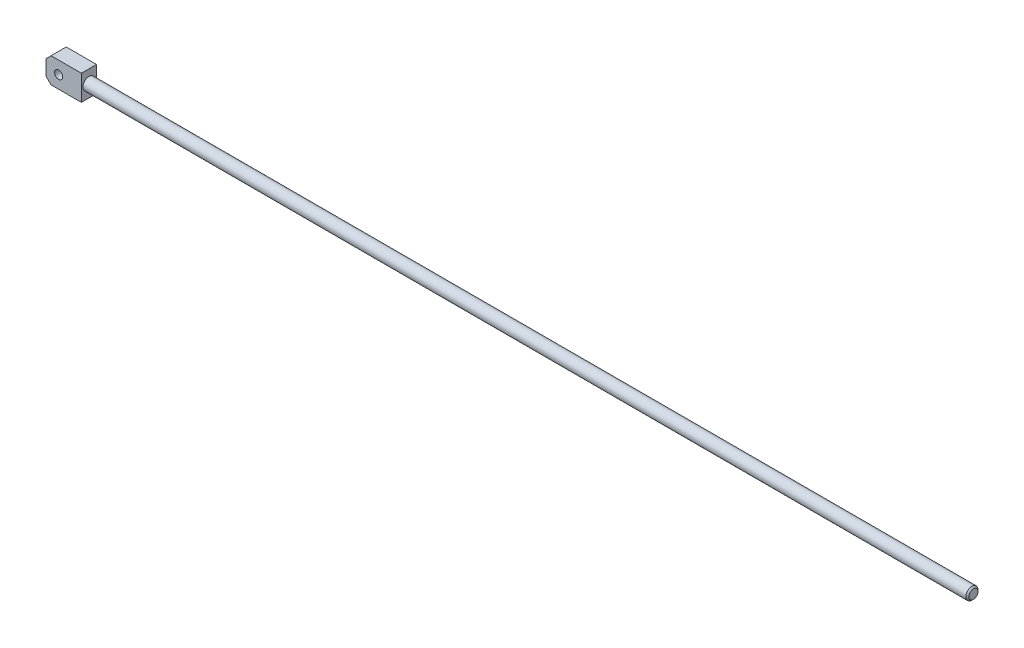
ISO-10303-21;
HEADER;
FILE_DESCRIPTION(('STEP AP214'),'2;1');
FILE_NAME('part.step','',(''),(''),'','','');
FILE_SCHEMA(('AUTOMOTIVE_DESIGN { 1 0 10303 214 1 1 1 1 }'));
ENDSEC;
DATA;
#1=APPLICATION_CONTEXT('core data for automotive mechanical design processes');
#2=APPLICATION_PROTOCOL_DEFINITION('international standard','automotive_design',2000,#1);
#3=PRODUCT_CONTEXT('',#1,'mechanical');
#4=PRODUCT('Part','Part','',(#3));
#5=PRODUCT_RELATED_PRODUCT_CATEGORY('part','',(#4));
#6=PRODUCT_DEFINITION_FORMATION('','',#4);
#7=PRODUCT_DEFINITION_CONTEXT('part definition',#1,'design');
#8=PRODUCT_DEFINITION('design','',#6,#7);
#9=PRODUCT_DEFINITION_SHAPE('','',#8);
#10=(LENGTH_UNIT() NAMED_UNIT(*) SI_UNIT(.MILLI.,.METRE.));
#11=(NAMED_UNIT(*) PLANE_ANGLE_UNIT() SI_UNIT($,.RADIAN.));
#12=(NAMED_UNIT(*) SI_UNIT($,.STERADIAN.) SOLID_ANGLE_UNIT());
#13=UNCERTAINTY_MEASURE_WITH_UNIT(LENGTH_MEASURE(1.E-05),#10,'distance_accuracy_value','');
#14=(GEOMETRIC_REPRESENTATION_CONTEXT(3) GLOBAL_UNCERTAINTY_ASSIGNED_CONTEXT((#13)) GLOBAL_UNIT_ASSIGNED_CONTEXT((#10,
#11,#12)) REPRESENTATION_CONTEXT('',''));
#15=CARTESIAN_POINT('',(0.,0.,0.));
#16=DIRECTION('',(0.,0.,1.));
#17=DIRECTION('',(1.,0.,0.));
#18=AXIS2_PLACEMENT_3D('',#15,#16,#17);
#19=CARTESIAN_POINT('',(-29.9734743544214,-35.8753324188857,0.));
#20=DIRECTION('',(-1.,0.,0.));
#21=DIRECTION('',(0.,0.,1.));
#22=AXIS2_PLACEMENT_3D('',#19,#20,#21);
#23=PLANE('',#22);
#24=DIRECTION('',(0.,0.,1.));
#25=VECTOR('',#24,1.);
#26=CARTESIAN_POINT('',(-29.9734743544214,4.12466758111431,0.));
#27=LINE('',#26,#25);
#28=CARTESIAN_POINT('',(-29.9734743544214,4.12466758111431,0.));
#29=VERTEX_POINT('',#28);
#30=CARTESIAN_POINT('',(-29.9734743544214,4.12466758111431,30.));
#31=VERTEX_POINT('',#30);
#32=EDGE_CURVE('E77',#29,#31,#27,.T.);
#33=ORIENTED_EDGE('',*,*,#32,.F.);
#34=DIRECTION('',(0.,1.,0.));
#35=VECTOR('',#34,1.);
#36=CARTESIAN_POINT('',(-29.9734743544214,-10.8753324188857,0.));
#37=LINE('',#36,#35);
#38=CARTESIAN_POINT('',(-29.9734743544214,-25.8753324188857,0.));
#39=VERTEX_POINT('',#38);
#40=EDGE_CURVE('E107',#29,#39,#37,.F.);
#41=ORIENTED_EDGE('',*,*,#40,.T.);
#42=DIRECTION('',(0.,0.,1.));
#43=VECTOR('',#42,1.);
#44=CARTESIAN_POINT('',(-29.9734743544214,-25.8753324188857,0.));
#45=LINE('',#44,#43);
#46=CARTESIAN_POINT('',(-29.9734743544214,-25.8753324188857,30.));
#47=VERTEX_POINT('',#46);
#48=EDGE_CURVE('E84',#47,#39,#45,.F.);
#49=ORIENTED_EDGE('',*,*,#48,.F.);
#50=DIRECTION('',(0.,1.,0.));
#51=VECTOR('',#50,1.);
#52=CARTESIAN_POINT('',(-29.9734743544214,-10.8753324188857,30.));
#53=LINE('',#52,#51);
#54=EDGE_CURVE('E87',#31,#47,#53,.F.);
#55=ORIENTED_EDGE('',*,*,#54,.F.);
#56=EDGE_LOOP('',(#33,#41,#49,#55));
#57=FACE_BOUND('',#56,.T.);
#58=ADVANCED_FACE('F16',(#57),#23,.T.);
#59=CARTESIAN_POINT('',(-24.9734743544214,-30.8753324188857,0.));
#60=DIRECTION('',(-0.707106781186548,-0.707106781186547,0.));
#61=DIRECTION('',(0.707106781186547,-0.707106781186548,0.));
#62=AXIS2_PLACEMENT_3D('',#59,#60,#61);
#63=PLANE('',#62);
#64=DIRECTION('',(0.707106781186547,-0.707106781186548,0.));
#65=VECTOR('',#64,1.);
#66=CARTESIAN_POINT('',(-29.9734743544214,-25.8753324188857,0.));
#67=LINE('',#66,#65);
#68=CARTESIAN_POINT('',(-19.9734743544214,-35.8753324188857,0.));
#69=VERTEX_POINT('',#68);
#70=EDGE_CURVE('E103',#39,#69,#67,.T.);
#71=ORIENTED_EDGE('',*,*,#70,.T.);
#72=DIRECTION('',(0.,0.,-1.));
#73=VECTOR('',#72,1.);
#74=CARTESIAN_POINT('',(-19.9734743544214,-35.8753324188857,0.));
#75=LINE('',#74,#73);
#76=CARTESIAN_POINT('',(-19.9734743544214,-35.8753324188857,30.));
#77=VERTEX_POINT('',#76);
#78=EDGE_CURVE('E101',#77,#69,#75,.T.);
#79=ORIENTED_EDGE('',*,*,#78,.F.);
#80=DIRECTION('',(0.707106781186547,-0.707106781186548,0.));
#81=VECTOR('',#80,1.);
#82=CARTESIAN_POINT('',(-29.9734743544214,-25.8753324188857,30.));
#83=LINE('',#82,#81);
#84=EDGE_CURVE('E83',#47,#77,#83,.T.);
#85=ORIENTED_EDGE('',*,*,#84,.F.);
#86=ORIENTED_EDGE('',*,*,#48,.T.);
#87=EDGE_LOOP('',(#71,#79,#85,#86));
#88=FACE_BOUND('',#87,.T.);
#89=ADVANCED_FACE('F141',(#88),#63,.T.);
#90=CARTESIAN_POINT('',(-4.97347435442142,-10.8753324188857,30.));
#91=DIRECTION('',(0.,0.,-1.));
#92=DIRECTION('',(-1.,0.,0.));
#93=AXIS2_PLACEMENT_3D('',#90,#91,#92);
#94=CYLINDRICAL_SURFACE('',#93,8.);
#95=CARTESIAN_POINT('',(-4.97347435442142,-10.8753324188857,0.));
#96=DIRECTION('',(0.,0.,-1.));
#97=DIRECTION('',(-1.,0.,0.));
#98=AXIS2_PLACEMENT_3D('',#95,#96,#97);
#99=CIRCLE('',#98,8.);
#100=CARTESIAN_POINT('',(-12.9734743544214,-10.8753324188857,0.));
#101=VERTEX_POINT('',#100);
#102=EDGE_CURVE('E106',#101,#101,#99,.T.);
#103=ORIENTED_EDGE('',*,*,#102,.T.);
#104=EDGE_LOOP('',(#103));
#105=FACE_BOUND('',#104,.T.);
#106=CARTESIAN_POINT('',(-4.97347435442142,-10.8753324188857,30.));
#107=DIRECTION('',(0.,0.,-1.));
#108=DIRECTION('',(-1.,0.,0.));
#109=AXIS2_PLACEMENT_3D('',#106,#107,#108);
#110=CIRCLE('',#109,8.);
#111=CARTESIAN_POINT('',(-12.9734743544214,-10.8753324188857,30.));
#112=VERTEX_POINT('',#111);
#113=EDGE_CURVE('E20',#112,#112,#110,.T.);
#114=ORIENTED_EDGE('',*,*,#113,.F.);
#115=EDGE_LOOP('',(#114));
#116=FACE_BOUND('',#115,.T.);
#117=ADVANCED_FACE('F18',(#105,#116),#94,.F.);
#118=CARTESIAN_POINT('',(-24.9734743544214,9.12466758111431,0.));
#119=DIRECTION('',(-0.707106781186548,0.707106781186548,0.));
#120=DIRECTION('',(-0.707106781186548,-0.707106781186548,0.));
#121=AXIS2_PLACEMENT_3D('',#118,#119,#120);
#122=PLANE('',#121);
#123=DIRECTION('',(-0.707106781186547,-0.707106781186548,0.));
#124=VECTOR('',#123,1.);
#125=CARTESIAN_POINT('',(-19.9734743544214,14.1246675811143,0.));
#126=LINE('',#125,#124);
#127=CARTESIAN_POINT('',(-19.9734743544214,14.1246675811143,0.));
#128=VERTEX_POINT('',#127);
#129=EDGE_CURVE('E80',#128,#29,#126,.T.);
#130=ORIENTED_EDGE('',*,*,#129,.T.);
#131=ORIENTED_EDGE('',*,*,#32,.T.);
#132=DIRECTION('',(-0.707106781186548,-0.707106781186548,0.));
#133=VECTOR('',#132,1.);
#134=CARTESIAN_POINT('',(-19.9734743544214,14.1246675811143,30.));
#135=LINE('',#134,#133);
#136=CARTESIAN_POINT('',(-19.9734743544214,14.1246675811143,30.));
#137=VERTEX_POINT('',#136);
#138=EDGE_CURVE('E56',#137,#31,#135,.T.);
#139=ORIENTED_EDGE('',*,*,#138,.F.);
#140=DIRECTION('',(0.,0.,1.));
#141=VECTOR('',#140,1.);
#142=CARTESIAN_POINT('',(-19.9734743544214,14.1246675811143,0.));
#143=LINE('',#142,#141);
#144=EDGE_CURVE('E60',#128,#137,#143,.T.);
#145=ORIENTED_EDGE('',*,*,#144,.F.);
#146=EDGE_LOOP('',(#130,#131,#139,#145));
#147=FACE_BOUND('',#146,.T.);
#148=ADVANCED_FACE('F79',(#147),#122,.T.);
#149=CARTESIAN_POINT('',(1790.02652564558,-10.8753324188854,15.));
#150=DIRECTION('',(-1.,0.,0.));
#151=DIRECTION('',(0.,0.,1.));
#152=AXIS2_PLACEMENT_3D('',#149,#150,#151);
#153=PLANE('',#152);
#154=CARTESIAN_POINT('',(1790.02652564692,-10.8753324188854,15.));
#155=DIRECTION('',(-1.,0.,0.));
#156=DIRECTION('',(0.,0.,1.));
#157=AXIS2_PLACEMENT_3D('',#154,#155,#156);
#158=CIRCLE('',#157,9.0000000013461);
#159=CARTESIAN_POINT('',(1790.02652564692,-10.8753324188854,24.0000000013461));
#160=VERTEX_POINT('',#159);
#161=EDGE_CURVE('E112',#160,#160,#158,.T.);
#162=ORIENTED_EDGE('',*,*,#161,.F.);
#163=EDGE_LOOP('',(#162));
#164=FACE_BOUND('',#163,.T.);
#165=ADVANCED_FACE('F176',(#164),#153,.F.);
#166=CARTESIAN_POINT('',(5.02652564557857,-10.8753324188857,30.));
#167=DIRECTION('',(0.,0.,1.));
#168=DIRECTION('',(1.,0.,0.));
#169=AXIS2_PLACEMENT_3D('',#166,#167,#168);
#170=PLANE('',#169);
#171=ORIENTED_EDGE('',*,*,#113,.T.);
#172=EDGE_LOOP('',(#171));
#173=FACE_BOUND('',#172,.T.);
#174=ORIENTED_EDGE('',*,*,#138,.T.);
#175=ORIENTED_EDGE('',*,*,#54,.T.);
#176=ORIENTED_EDGE('',*,*,#84,.T.);
#177=DIRECTION('',(1.,0.,0.));
#178=VECTOR('',#177,1.);
#179=CARTESIAN_POINT('',(40.0265256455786,-35.8753324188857,30.));
#180=LINE('',#179,#178);
#181=CARTESIAN_POINT('',(40.0265256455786,-35.8753324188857,30.));
#182=VERTEX_POINT('',#181);
#183=EDGE_CURVE('E97',#182,#77,#180,.F.);
#184=ORIENTED_EDGE('',*,*,#183,.F.);
#185=DIRECTION('',(0.,1.,0.));
#186=VECTOR('',#185,1.);
#187=CARTESIAN_POINT('',(40.0265256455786,14.1246675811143,30.));
#188=LINE('',#187,#186);
#189=CARTESIAN_POINT('',(40.0265256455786,14.1246675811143,30.));
#190=VERTEX_POINT('',#189);
#191=EDGE_CURVE('E48',#190,#182,#188,.F.);
#192=ORIENTED_EDGE('',*,*,#191,.F.);
#193=DIRECTION('',(1.,0.,0.));
#194=VECTOR('',#193,1.);
#195=CARTESIAN_POINT('',(-29.9734743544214,14.1246675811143,30.));
#196=LINE('',#195,#194);
#197=EDGE_CURVE('E93',#137,#190,#196,.T.);
#198=ORIENTED_EDGE('',*,*,#197,.F.);
#199=EDGE_LOOP('',(#174,#175,#176,#184,#192,#198));
#200=FACE_BOUND('',#199,.T.);
#201=ADVANCED_FACE('F92',(#173,#200),#170,.T.);
#202=CARTESIAN_POINT('',(40.0265256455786,-35.8753324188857,0.));
#203=DIRECTION('',(0.,-1.,0.));
#204=DIRECTION('',(0.,0.,-1.));
#205=AXIS2_PLACEMENT_3D('',#202,#203,#204);
#206=PLANE('',#205);
#207=DIRECTION('',(0.,0.,-1.));
#208=VECTOR('',#207,1.);
#209=CARTESIAN_POINT('',(40.0265256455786,-35.8753324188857,0.));
#210=LINE('',#209,#208);
#211=CARTESIAN_POINT('',(40.0265256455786,-35.8753324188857,0.));
#212=VERTEX_POINT('',#211);
#213=EDGE_CURVE('E121',#182,#212,#210,.T.);
#214=ORIENTED_EDGE('',*,*,#213,.F.);
#215=ORIENTED_EDGE('',*,*,#183,.T.);
#216=ORIENTED_EDGE('',*,*,#78,.T.);
#217=DIRECTION('',(1.,0.,0.));
#218=VECTOR('',#217,1.);
#219=CARTESIAN_POINT('',(5.02652564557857,-35.8753324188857,0.));
#220=LINE('',#219,#218);
#221=EDGE_CURVE('E100',#69,#212,#220,.T.);
#222=ORIENTED_EDGE('',*,*,#221,.T.);
#223=EDGE_LOOP('',(#214,#215,#216,#222));
#224=FACE_BOUND('',#223,.T.);
#225=ADVANCED_FACE('F136',(#224),#206,.T.);
#226=CARTESIAN_POINT('',(5.02652564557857,-10.8753324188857,0.));
#227=DIRECTION('',(0.,0.,1.));
#228=DIRECTION('',(1.,0.,0.));
#229=AXIS2_PLACEMENT_3D('',#226,#227,#228);
#230=PLANE('',#229);
#231=ORIENTED_EDGE('',*,*,#102,.F.);
#232=EDGE_LOOP('',(#231));
#233=FACE_BOUND('',#232,.T.);
#234=ORIENTED_EDGE('',*,*,#40,.F.);
#235=ORIENTED_EDGE('',*,*,#129,.F.);
#236=DIRECTION('',(1.,0.,0.));
#237=VECTOR('',#236,1.);
#238=CARTESIAN_POINT('',(-29.9734743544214,14.1246675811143,0.));
#239=LINE('',#238,#237);
#240=CARTESIAN_POINT('',(40.0265256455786,14.1246675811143,0.));
#241=VERTEX_POINT('',#240);
#242=EDGE_CURVE('E35',#241,#128,#239,.F.);
#243=ORIENTED_EDGE('',*,*,#242,.F.);
#244=DIRECTION('',(0.,1.,0.));
#245=VECTOR('',#244,1.);
#246=CARTESIAN_POINT('',(40.0265256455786,14.1246675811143,0.));
#247=LINE('',#246,#245);
#248=EDGE_CURVE('E118',#212,#241,#247,.T.);
#249=ORIENTED_EDGE('',*,*,#248,.F.);
#250=ORIENTED_EDGE('',*,*,#221,.F.);
#251=ORIENTED_EDGE('',*,*,#70,.F.);
#252=EDGE_LOOP('',(#234,#235,#243,#249,#250,#251));
#253=FACE_BOUND('',#252,.T.);
#254=ADVANCED_FACE('F133',(#233,#253),#230,.F.);
#255=CARTESIAN_POINT('',(-29.9734743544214,14.1246675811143,0.));
#256=DIRECTION('',(0.,1.,0.));
#257=DIRECTION('',(0.,0.,1.));
#258=AXIS2_PLACEMENT_3D('',#255,#256,#257);
#259=PLANE('',#258);
#260=DIRECTION('',(0.,0.,-1.));
#261=VECTOR('',#260,1.);
#262=CARTESIAN_POINT('',(40.0265256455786,14.1246675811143,0.));
#263=LINE('',#262,#261);
#264=EDGE_CURVE('E115',#241,#190,#263,.F.);
#265=ORIENTED_EDGE('',*,*,#264,.F.);
#266=ORIENTED_EDGE('',*,*,#242,.T.);
#267=ORIENTED_EDGE('',*,*,#144,.T.);
#268=ORIENTED_EDGE('',*,*,#197,.T.);
#269=EDGE_LOOP('',(#265,#266,#267,#268));
#270=FACE_BOUND('',#269,.T.);
#271=ADVANCED_FACE('F135',(#270),#259,.T.);
#272=CARTESIAN_POINT('',(1787.02652564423,-10.8753324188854,15.));
#273=DIRECTION('',(-1.,0.,0.));
#274=DIRECTION('',(0.,0.,1.));
#275=AXIS2_PLACEMENT_3D('',#272,#273,#274);
#276=CONICAL_SURFACE('',#275,11.9999999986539,0.785398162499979);
#277=ORIENTED_EDGE('',*,*,#161,.T.);
#278=EDGE_LOOP('',(#277));
#279=FACE_BOUND('',#278,.T.);
#280=CARTESIAN_POINT('',(1787.02652564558,-10.8753324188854,15.));
#281=DIRECTION('',(1.,0.,0.));
#282=DIRECTION('',(0.,1.,0.));
#283=AXIS2_PLACEMENT_3D('',#280,#281,#282);
#284=CIRCLE('',#283,12.);
#285=CARTESIAN_POINT('',(1787.02652564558,1.12466758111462,15.));
#286=VERTEX_POINT('',#285);
#287=EDGE_CURVE('E26',#286,#286,#284,.F.);
#288=ORIENTED_EDGE('',*,*,#287,.F.);
#289=EDGE_LOOP('',(#288));
#290=FACE_BOUND('',#289,.T.);
#291=ADVANCED_FACE('F149',(#279,#290),#276,.T.);
#292=CARTESIAN_POINT('',(40.0265256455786,14.1246675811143,0.));
#293=DIRECTION('',(1.,0.,0.));
#294=DIRECTION('',(0.,0.,-1.));
#295=AXIS2_PLACEMENT_3D('',#292,#293,#294);
#296=PLANE('',#295);
#297=CARTESIAN_POINT('',(40.0265256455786,-10.8753324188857,15.));
#298=DIRECTION('',(1.,0.,0.));
#299=DIRECTION('',(0.,1.,0.));
#300=AXIS2_PLACEMENT_3D('',#297,#298,#299);
#301=CIRCLE('',#300,12.);
#302=CARTESIAN_POINT('',(40.0265256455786,1.12466758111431,15.));
#303=VERTEX_POINT('',#302);
#304=EDGE_CURVE('E10',#303,#303,#301,.T.);
#305=ORIENTED_EDGE('',*,*,#304,.F.);
#306=EDGE_LOOP('',(#305));
#307=FACE_BOUND('',#306,.T.);
#308=ORIENTED_EDGE('',*,*,#248,.T.);
#309=ORIENTED_EDGE('',*,*,#264,.T.);
#310=ORIENTED_EDGE('',*,*,#191,.T.);
#311=ORIENTED_EDGE('',*,*,#213,.T.);
#312=EDGE_LOOP('',(#308,#309,#310,#311));
#313=FACE_BOUND('',#312,.T.);
#314=ADVANCED_FACE('F146',(#307,#313),#296,.T.);
#315=CARTESIAN_POINT('',(40.0265256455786,-10.8753324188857,15.));
#316=DIRECTION('',(1.,0.,0.));
#317=DIRECTION('',(0.,1.,0.));
#318=AXIS2_PLACEMENT_3D('',#315,#316,#317);
#319=CYLINDRICAL_SURFACE('',#318,12.);
#320=ORIENTED_EDGE('',*,*,#287,.T.);
#321=EDGE_LOOP('',(#320));
#322=FACE_BOUND('',#321,.T.);
#323=ORIENTED_EDGE('',*,*,#304,.T.);
#324=EDGE_LOOP('',(#323));
#325=FACE_BOUND('',#324,.T.);
#326=ADVANCED_FACE('F156',(#322,#325),#319,.T.);
#327=CLOSED_SHELL('',(#58,#89,#117,#148,#165,#201,#225,#254,#271,#291,#314,#326));
#328=MANIFOLD_SOLID_BREP('B1',#327);
#329=ADVANCED_BREP_SHAPE_REPRESENTATION('',(#18,#328),#14);
#330=SHAPE_DEFINITION_REPRESENTATION(#9,#329);
ENDSEC;
END-ISO-10303-21;
